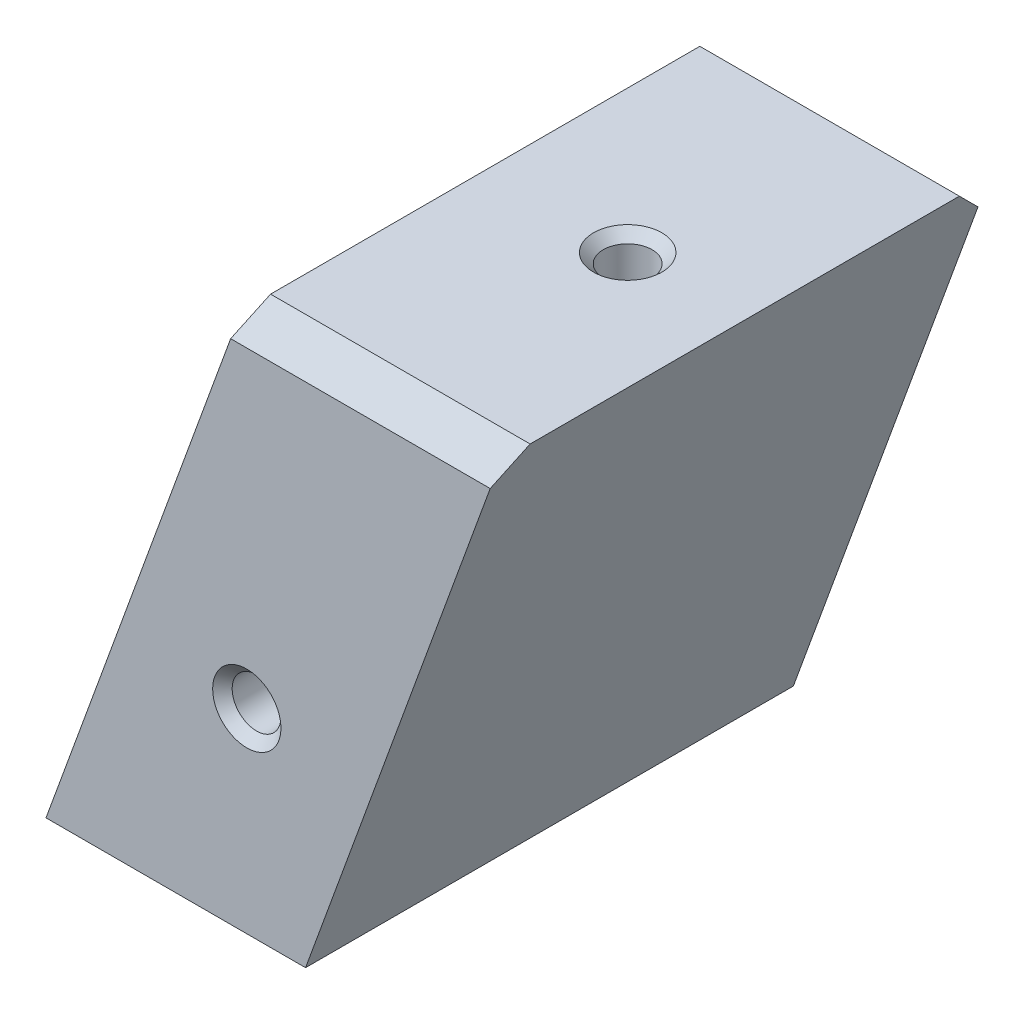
from build123d import *

# Parameters (mm, degrees)
EXTRUSION1_DEPTH                    = 25
DIAM_TRE_DU_PER_AGE_8_5_8_5_1_D     = 8.5
DIAM_TRE_DU_PER_AGE_8_5_8_5_1_DEPTH = 24.5
DIAM_TRE_DU_PER_AGE_8_5_8_5_1_TIP   = 2.553657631
CHANFREIN1_SIZE                     = 1
ESQUISSE4_W                         = 28
ESQUISSE4_H                         = 9
CHANFREIN2_SIZE                     = 3
DIAM_TRE_DU_PER_AGE_5_0_5_1_D       = 5
DIAM_TRE_DU_PER_AGE_5_0_5_1_DEPTH   = 15
DIAM_TRE_DU_PER_AGE_5_0_5_1_TIP     = 1.502151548
CHANFREIN3_SIZE                     = 1
DIAM_TRE_DU_PER_AGE_5_0_5_2_D       = 5
DIAM_TRE_DU_PER_AGE_5_0_5_2_DEPTH   = 15
DIAM_TRE_DU_PER_AGE_5_0_5_2_TIP     = 1.502151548
CHANFREIN4_SIZE                     = 1
DIAM_TRE_DU_PER_AGE_5_0_5_3_D       = 5
DIAM_TRE_DU_PER_AGE_5_0_5_3_DEPTH   = 15
DIAM_TRE_DU_PER_AGE_5_0_5_3_TIP     = 1.502151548
CHANFREIN5_SIZE                     = 1


with BuildPart() as part:
    # Esquisse1 → Extrusion1 (new, symmetric)
    with BuildSketch(Plane.XY):
        Polygon((0, 0), (26.604444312, 0), (46.622807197, 55), (20.018362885, 55), align=None)
    extrude(amount=EXTRUSION1_DEPTH, both=True)

    # Diam_tre du per_age _8.5 _8.5_1
    with Locations(Plane.XZ):
        with Locations((15, 16.4), (15, -13.6)):
            Hole(DIAM_TRE_DU_PER_AGE_8_5_8_5_1_D / 2, depth=DIAM_TRE_DU_PER_AGE_8_5_8_5_1_DEPTH)
            with Locations((0, 0, -(DIAM_TRE_DU_PER_AGE_8_5_8_5_1_DEPTH + DIAM_TRE_DU_PER_AGE_8_5_8_5_1_TIP / 2))):  # 118° drill point
                Cone(0, DIAM_TRE_DU_PER_AGE_8_5_8_5_1_D / 2, DIAM_TRE_DU_PER_AGE_8_5_8_5_1_TIP, mode=Mode.SUBTRACT)

    # Chanfrein1
    chanfrein1_edges = [part.edges().sort_by_distance(p)[0] for p in [
        (19.25, 0, -13.6),
        (19.25, 0, 16.4),
    ]]
    chamfer(chanfrein1_edges, length=CHANFREIN1_SIZE)

    # Esquisse4 → Enl_vement de mati_re-R_volution1 (revolve, cut)
    with BuildSketch(Plane.XY.offset(2), mode=Mode.PRIVATE) as enl_vement_de_mati_re_r_volution1_sk:
        with Locations((14, 25.5)):
            Rectangle(ESQUISSE4_W, ESQUISSE4_H)
    revolve(enl_vement_de_mati_re_r_volution1_sk.sketch.rotate(Axis((-32.846713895, 30, 2), (1, 0, 0)), 270), axis=Axis((-32.846713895, 30, 2), (1, 0, 0)), mode=Mode.SUBTRACT)

    # Chanfrein2
    chanfrein2_edges = [part.edges().sort_by_distance(p)[0] for p in [
        (33.320585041, 55, 25),
        (33.320585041, 55, -25),
    ]]
    chamfer(chanfrein2_edges, length=CHANFREIN2_SIZE)

    # Diam_tre du per_age _5.0 _5_1
    with Locations(Plane(origin=(0, 0, -25), x_dir=(-1, 0, 0), z_dir=(0, 0, -1))):
        with Locations((-20.581626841, 20)):
            Hole(DIAM_TRE_DU_PER_AGE_5_0_5_1_D / 2, depth=DIAM_TRE_DU_PER_AGE_5_0_5_1_DEPTH)
            with Locations((0, 0, -(DIAM_TRE_DU_PER_AGE_5_0_5_1_DEPTH + DIAM_TRE_DU_PER_AGE_5_0_5_1_TIP / 2))):  # 118° drill point
                Cone(0, DIAM_TRE_DU_PER_AGE_5_0_5_1_D / 2, DIAM_TRE_DU_PER_AGE_5_0_5_1_TIP, mode=Mode.SUBTRACT)

    # Chanfrein3
    chanfrein3_edges = [part.edges().sort_by_distance(p)[0] for p in [
        (18.081626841, 20, -25),
    ]]
    chamfer(chanfrein3_edges, length=CHANFREIN3_SIZE)

    # Diam_tre du per_age _5.0 _5_2
    with Locations(Plane.XY.offset(25)):
        with Locations((20.581626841, 20)):
            Hole(DIAM_TRE_DU_PER_AGE_5_0_5_2_D / 2, depth=DIAM_TRE_DU_PER_AGE_5_0_5_2_DEPTH)
            with Locations((0, 0, -(DIAM_TRE_DU_PER_AGE_5_0_5_2_DEPTH + DIAM_TRE_DU_PER_AGE_5_0_5_2_TIP / 2))):  # 118° drill point
                Cone(0, DIAM_TRE_DU_PER_AGE_5_0_5_2_D / 2, DIAM_TRE_DU_PER_AGE_5_0_5_2_TIP, mode=Mode.SUBTRACT)

    # Chanfrein4
    chanfrein4_edges = [part.edges().sort_by_distance(p)[0] for p in [
        (23.081626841, 20, 25),
    ]]
    chamfer(chanfrein4_edges, length=CHANFREIN4_SIZE)

    # Diam_tre du per_age _5.0 _5_3
    with Locations(Plane(origin=(0, 55, 0), x_dir=(-1, 0, 0), z_dir=(0, 1, 0))):
        with Locations((-34.622807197, 0)):
            Hole(DIAM_TRE_DU_PER_AGE_5_0_5_3_D / 2, depth=DIAM_TRE_DU_PER_AGE_5_0_5_3_DEPTH)
            with Locations((0, 0, -(DIAM_TRE_DU_PER_AGE_5_0_5_3_DEPTH + DIAM_TRE_DU_PER_AGE_5_0_5_3_TIP / 2))):  # 118° drill point
                Cone(0, DIAM_TRE_DU_PER_AGE_5_0_5_3_D / 2, DIAM_TRE_DU_PER_AGE_5_0_5_3_TIP, mode=Mode.SUBTRACT)

    # Chanfrein5
    chanfrein5_edges = [part.edges().sort_by_distance(p)[0] for p in [
        (32.122807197, 55, 0),
    ]]
    chamfer(chanfrein5_edges, length=CHANFREIN5_SIZE)


solid = part.part
